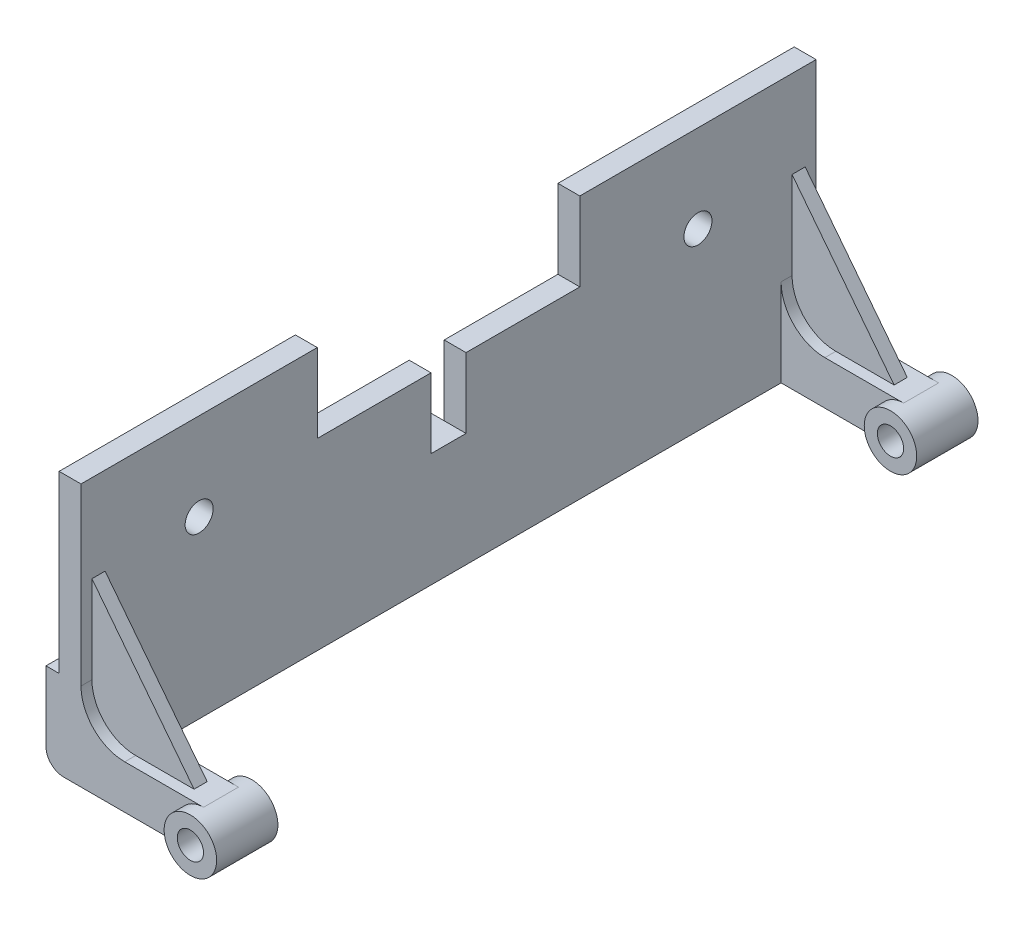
ISO-10303-21;
HEADER;
FILE_DESCRIPTION(('STEP AP214'),'2;1');
FILE_NAME('part.step','',(''),(''),'','','');
FILE_SCHEMA(('AUTOMOTIVE_DESIGN { 1 0 10303 214 1 1 1 1 }'));
ENDSEC;
DATA;
#1=APPLICATION_CONTEXT('core data for automotive mechanical design processes');
#2=APPLICATION_PROTOCOL_DEFINITION('international standard','automotive_design',2000,#1);
#3=PRODUCT_CONTEXT('',#1,'mechanical');
#4=PRODUCT('Part','Part','',(#3));
#5=PRODUCT_RELATED_PRODUCT_CATEGORY('part','',(#4));
#6=PRODUCT_DEFINITION_FORMATION('','',#4);
#7=PRODUCT_DEFINITION_CONTEXT('part definition',#1,'design');
#8=PRODUCT_DEFINITION('design','',#6,#7);
#9=PRODUCT_DEFINITION_SHAPE('','',#8);
#10=(LENGTH_UNIT() NAMED_UNIT(*) SI_UNIT(.MILLI.,.METRE.));
#11=(NAMED_UNIT(*) PLANE_ANGLE_UNIT() SI_UNIT($,.RADIAN.));
#12=(NAMED_UNIT(*) SI_UNIT($,.STERADIAN.) SOLID_ANGLE_UNIT());
#13=UNCERTAINTY_MEASURE_WITH_UNIT(LENGTH_MEASURE(1.E-05),#10,'distance_accuracy_value','');
#14=(GEOMETRIC_REPRESENTATION_CONTEXT(3) GLOBAL_UNCERTAINTY_ASSIGNED_CONTEXT((#13)) GLOBAL_UNIT_ASSIGNED_CONTEXT((#10,
#11,#12)) REPRESENTATION_CONTEXT('',''));
#15=CARTESIAN_POINT('',(0.,0.,0.));
#16=DIRECTION('',(0.,0.,1.));
#17=DIRECTION('',(1.,0.,0.));
#18=AXIS2_PLACEMENT_3D('',#15,#16,#17);
#19=CARTESIAN_POINT('',(-18.,8.,42.));
#20=DIRECTION('',(0.,1.,0.));
#21=DIRECTION('',(0.,0.,1.));
#22=AXIS2_PLACEMENT_3D('',#19,#20,#21);
#23=PLANE('',#22);
#24=DIRECTION('',(0.,0.,-1.));
#25=VECTOR('',#24,1.);
#26=CARTESIAN_POINT('',(-16.5,8.,42.));
#27=LINE('',#26,#25);
#28=CARTESIAN_POINT('',(-16.5,8.,42.));
#29=VERTEX_POINT('',#28);
#30=CARTESIAN_POINT('',(-16.5,8.,2.00000000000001));
#31=VERTEX_POINT('',#30);
#32=EDGE_CURVE('E281',#29,#31,#27,.T.);
#33=ORIENTED_EDGE('',*,*,#32,.T.);
#34=DIRECTION('',(1.,0.,0.));
#35=VECTOR('',#34,1.);
#36=CARTESIAN_POINT('',(-23.,7.99999999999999,2.00000000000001));
#37=LINE('',#36,#35);
#38=CARTESIAN_POINT('',(-18.,7.99999999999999,2.00000000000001));
#39=VERTEX_POINT('',#38);
#40=EDGE_CURVE('E275',#39,#31,#37,.T.);
#41=ORIENTED_EDGE('',*,*,#40,.F.);
#42=DIRECTION('',(0.,0.,-1.));
#43=VECTOR('',#42,1.);
#44=CARTESIAN_POINT('',(-18.,8.,42.));
#45=LINE('',#44,#43);
#46=CARTESIAN_POINT('',(-18.,8.,42.));
#47=VERTEX_POINT('',#46);
#48=EDGE_CURVE('E290',#47,#39,#45,.T.);
#49=ORIENTED_EDGE('',*,*,#48,.F.);
#50=DIRECTION('',(1.,0.,0.));
#51=VECTOR('',#50,1.);
#52=CARTESIAN_POINT('',(-18.,8.,42.));
#53=LINE('',#52,#51);
#54=EDGE_CURVE('E558',#47,#29,#53,.T.);
#55=ORIENTED_EDGE('',*,*,#54,.T.);
#56=EDGE_LOOP('',(#33,#41,#49,#55));
#57=FACE_BOUND('',#56,.T.);
#58=ADVANCED_FACE('F32',(#57),#23,.T.);
#59=CARTESIAN_POINT('',(-18.,8.,-2.));
#60=VERTEX_POINT('',#59);
#61=CARTESIAN_POINT('',(-18.,8.,-42.));
#62=VERTEX_POINT('',#61);
#63=EDGE_CURVE('E273',#60,#62,#45,.T.);
#64=ORIENTED_EDGE('',*,*,#63,.F.);
#65=DIRECTION('',(1.,0.,0.));
#66=VECTOR('',#65,1.);
#67=CARTESIAN_POINT('',(-23.,7.99999999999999,-2.));
#68=LINE('',#67,#66);
#69=CARTESIAN_POINT('',(-16.5,8.,-2.));
#70=VERTEX_POINT('',#69);
#71=EDGE_CURVE('E258',#60,#70,#68,.T.);
#72=ORIENTED_EDGE('',*,*,#71,.T.);
#73=CARTESIAN_POINT('',(-16.5,8.,-42.));
#74=VERTEX_POINT('',#73);
#75=EDGE_CURVE('E271',#70,#74,#27,.T.);
#76=ORIENTED_EDGE('',*,*,#75,.T.);
#77=DIRECTION('',(1.,0.,0.));
#78=VECTOR('',#77,1.);
#79=CARTESIAN_POINT('',(-18.,8.,-42.));
#80=LINE('',#79,#78);
#81=EDGE_CURVE('E488',#62,#74,#80,.T.);
#82=ORIENTED_EDGE('',*,*,#81,.F.);
#83=EDGE_LOOP('',(#64,#72,#76,#82));
#84=FACE_BOUND('',#83,.T.);
#85=ADVANCED_FACE('F269',(#84),#23,.T.);
#86=CARTESIAN_POINT('',(-16.5,28.,42.));
#87=DIRECTION('',(-1.,0.,0.));
#88=DIRECTION('',(0.,-1.,0.));
#89=AXIS2_PLACEMENT_3D('',#86,#87,#88);
#90=PLANE('',#89);
#91=CARTESIAN_POINT('',(-16.5,18.,28.5));
#92=DIRECTION('',(-1.,0.,0.));
#93=DIRECTION('',(0.,-1.,0.));
#94=AXIS2_PLACEMENT_3D('',#91,#92,#93);
#95=CIRCLE('',#94,1.6);
#96=CARTESIAN_POINT('',(-16.5,16.4,28.5));
#97=VERTEX_POINT('',#96);
#98=EDGE_CURVE('E438',#97,#97,#95,.T.);
#99=ORIENTED_EDGE('',*,*,#98,.F.);
#100=EDGE_LOOP('',(#99));
#101=FACE_BOUND('',#100,.T.);
#102=DIRECTION('',(0.,1.,0.));
#103=VECTOR('',#102,1.);
#104=CARTESIAN_POINT('',(-16.5,28.,2.));
#105=LINE('',#104,#103);
#106=CARTESIAN_POINT('',(-16.5,11.,2.));
#107=VERTEX_POINT('',#106);
#108=CARTESIAN_POINT('',(-16.5,19.,2.));
#109=VERTEX_POINT('',#108);
#110=EDGE_CURVE('E1126',#107,#109,#105,.T.);
#111=ORIENTED_EDGE('',*,*,#110,.F.);
#112=DIRECTION('',(0.,1.,0.));
#113=VECTOR('',#112,1.);
#114=CARTESIAN_POINT('',(-16.5,11.,2.00000000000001));
#115=LINE('',#114,#113);
#116=EDGE_CURVE('E266',#31,#107,#115,.T.);
#117=ORIENTED_EDGE('',*,*,#116,.F.);
#118=ORIENTED_EDGE('',*,*,#32,.F.);
#119=DIRECTION('',(0.,1.,0.));
#120=VECTOR('',#119,1.);
#121=CARTESIAN_POINT('',(-16.5,28.,42.));
#122=LINE('',#121,#120);
#123=CARTESIAN_POINT('',(-16.5,28.,42.));
#124=VERTEX_POINT('',#123);
#125=EDGE_CURVE('E1157',#29,#124,#122,.T.);
#126=ORIENTED_EDGE('',*,*,#125,.T.);
#127=DIRECTION('',(0.,0.,-1.));
#128=VECTOR('',#127,1.);
#129=CARTESIAN_POINT('',(-16.5,28.,42.));
#130=LINE('',#129,#128);
#131=CARTESIAN_POINT('',(-16.5,28.,15.));
#132=VERTEX_POINT('',#131);
#133=EDGE_CURVE('E282',#124,#132,#130,.T.);
#134=ORIENTED_EDGE('',*,*,#133,.T.);
#135=DIRECTION('',(0.,1.,0.));
#136=VECTOR('',#135,1.);
#137=CARTESIAN_POINT('',(-16.5,28.,15.));
#138=LINE('',#137,#136);
#139=CARTESIAN_POINT('',(-16.5,19.,15.));
#140=VERTEX_POINT('',#139);
#141=EDGE_CURVE('E1117',#140,#132,#138,.T.);
#142=ORIENTED_EDGE('',*,*,#141,.F.);
#143=DIRECTION('',(0.,0.,1.));
#144=VECTOR('',#143,1.);
#145=CARTESIAN_POINT('',(-16.5,19.,-15.));
#146=LINE('',#145,#144);
#147=EDGE_CURVE('E1124',#109,#140,#146,.T.);
#148=ORIENTED_EDGE('',*,*,#147,.F.);
#149=EDGE_LOOP('',(#111,#117,#118,#126,#134,#142,#148));
#150=FACE_BOUND('',#149,.T.);
#151=ADVANCED_FACE('F655',(#101,#150),#90,.T.);
#152=CARTESIAN_POINT('',(-16.5,18.,-28.5));
#153=DIRECTION('',(1.,0.,0.));
#154=DIRECTION('',(0.,-1.,0.));
#155=AXIS2_PLACEMENT_3D('',#152,#153,#154);
#156=CIRCLE('',#155,1.6);
#157=CARTESIAN_POINT('',(-16.5,16.4,-28.5));
#158=VERTEX_POINT('',#157);
#159=EDGE_CURVE('E472',#158,#158,#156,.T.);
#160=ORIENTED_EDGE('',*,*,#159,.T.);
#161=EDGE_LOOP('',(#160));
#162=FACE_BOUND('',#161,.T.);
#163=ORIENTED_EDGE('',*,*,#75,.F.);
#164=DIRECTION('',(0.,-1.,0.));
#165=VECTOR('',#164,1.);
#166=CARTESIAN_POINT('',(-16.5,11.,-2.));
#167=LINE('',#166,#165);
#168=CARTESIAN_POINT('',(-16.5,11.,-2.));
#169=VERTEX_POINT('',#168);
#170=EDGE_CURVE('E254',#169,#70,#167,.T.);
#171=ORIENTED_EDGE('',*,*,#170,.F.);
#172=DIRECTION('',(0.,-1.,0.));
#173=VECTOR('',#172,1.);
#174=CARTESIAN_POINT('',(-16.5,28.,-1.99999999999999));
#175=LINE('',#174,#173);
#176=CARTESIAN_POINT('',(-16.5,19.,-2.));
#177=VERTEX_POINT('',#176);
#178=EDGE_CURVE('E1128',#177,#169,#175,.T.);
#179=ORIENTED_EDGE('',*,*,#178,.F.);
#180=CARTESIAN_POINT('',(-16.5,19.,-15.));
#181=VERTEX_POINT('',#180);
#182=EDGE_CURVE('E460',#181,#177,#146,.T.);
#183=ORIENTED_EDGE('',*,*,#182,.F.);
#184=DIRECTION('',(0.,-1.,0.));
#185=VECTOR('',#184,1.);
#186=CARTESIAN_POINT('',(-16.5,28.,-15.));
#187=LINE('',#186,#185);
#188=CARTESIAN_POINT('',(-16.5,28.,-15.));
#189=VERTEX_POINT('',#188);
#190=EDGE_CURVE('E55',#189,#181,#187,.T.);
#191=ORIENTED_EDGE('',*,*,#190,.F.);
#192=CARTESIAN_POINT('',(-16.5,28.,-42.));
#193=VERTEX_POINT('',#192);
#194=EDGE_CURVE('E286',#189,#193,#130,.T.);
#195=ORIENTED_EDGE('',*,*,#194,.T.);
#196=DIRECTION('',(0.,1.,0.));
#197=VECTOR('',#196,1.);
#198=CARTESIAN_POINT('',(-16.5,28.,-42.));
#199=LINE('',#198,#197);
#200=EDGE_CURVE('E279',#74,#193,#199,.T.);
#201=ORIENTED_EDGE('',*,*,#200,.F.);
#202=EDGE_LOOP('',(#163,#171,#179,#183,#191,#195,#201));
#203=FACE_BOUND('',#202,.T.);
#204=ADVANCED_FACE('F277',(#162,#203),#90,.T.);
#205=CARTESIAN_POINT('',(3.,19.,-15.));
#206=DIRECTION('',(0.,-1.,0.));
#207=DIRECTION('',(1.,0.,0.));
#208=AXIS2_PLACEMENT_3D('',#205,#206,#207);
#209=PLANE('',#208);
#210=DIRECTION('',(0.,0.,1.));
#211=VECTOR('',#210,1.);
#212=CARTESIAN_POINT('',(-14.,19.,42.));
#213=LINE('',#212,#211);
#214=CARTESIAN_POINT('',(-14.,19.,2.));
#215=VERTEX_POINT('',#214);
#216=CARTESIAN_POINT('',(-14.,19.,15.));
#217=VERTEX_POINT('',#216);
#218=EDGE_CURVE('E463',#215,#217,#213,.T.);
#219=ORIENTED_EDGE('',*,*,#218,.F.);
#220=DIRECTION('',(-1.,0.,0.));
#221=VECTOR('',#220,1.);
#222=CARTESIAN_POINT('',(3.,19.,2.));
#223=LINE('',#222,#221);
#224=EDGE_CURVE('E11',#215,#109,#223,.T.);
#225=ORIENTED_EDGE('',*,*,#224,.T.);
#226=ORIENTED_EDGE('',*,*,#147,.T.);
#227=DIRECTION('',(-1.,0.,0.));
#228=VECTOR('',#227,1.);
#229=CARTESIAN_POINT('',(3.,19.,15.));
#230=LINE('',#229,#228);
#231=EDGE_CURVE('E1110',#217,#140,#230,.T.);
#232=ORIENTED_EDGE('',*,*,#231,.F.);
#233=EDGE_LOOP('',(#219,#225,#226,#232));
#234=FACE_BOUND('',#233,.T.);
#235=ADVANCED_FACE('F829',(#234),#209,.F.);
#236=CARTESIAN_POINT('',(-18.,28.,42.));
#237=DIRECTION('',(0.,-1.,0.));
#238=DIRECTION('',(0.,0.,-1.));
#239=AXIS2_PLACEMENT_3D('',#236,#237,#238);
#240=PLANE('',#239);
#241=ORIENTED_EDGE('',*,*,#194,.F.);
#242=DIRECTION('',(-1.,0.,0.));
#243=VECTOR('',#242,1.);
#244=CARTESIAN_POINT('',(3.,28.,-15.));
#245=LINE('',#244,#243);
#246=CARTESIAN_POINT('',(-14.,28.,-15.));
#247=VERTEX_POINT('',#246);
#248=EDGE_CURVE('E376',#247,#189,#245,.T.);
#249=ORIENTED_EDGE('',*,*,#248,.F.);
#250=DIRECTION('',(0.,0.,-1.));
#251=VECTOR('',#250,1.);
#252=CARTESIAN_POINT('',(-14.,28.,42.));
#253=LINE('',#252,#251);
#254=CARTESIAN_POINT('',(-14.,28.,-42.));
#255=VERTEX_POINT('',#254);
#256=EDGE_CURVE('E359',#247,#255,#253,.T.);
#257=ORIENTED_EDGE('',*,*,#256,.T.);
#258=DIRECTION('',(-1.,0.,0.));
#259=VECTOR('',#258,1.);
#260=CARTESIAN_POINT('',(-18.,28.,-42.));
#261=LINE('',#260,#259);
#262=EDGE_CURVE('E375',#255,#193,#261,.T.);
#263=ORIENTED_EDGE('',*,*,#262,.T.);
#264=EDGE_LOOP('',(#241,#249,#257,#263));
#265=FACE_BOUND('',#264,.T.);
#266=ADVANCED_FACE('F373',(#265),#240,.F.);
#267=CARTESIAN_POINT('',(-18.,28.,42.));
#268=DIRECTION('',(0.,0.,-1.));
#269=DIRECTION('',(-1.,0.,0.));
#270=AXIS2_PLACEMENT_3D('',#267,#268,#269);
#271=PLANE('',#270);
#272=DIRECTION('',(0.,-1.,0.));
#273=VECTOR('',#272,1.);
#274=CARTESIAN_POINT('',(-18.,-2.,42.));
#275=LINE('',#274,#273);
#276=CARTESIAN_POINT('',(-18.,0.,42.));
#277=VERTEX_POINT('',#276);
#278=EDGE_CURVE('E325',#47,#277,#275,.T.);
#279=ORIENTED_EDGE('',*,*,#278,.T.);
#280=CARTESIAN_POINT('',(-16.,0.,42.));
#281=DIRECTION('',(0.,0.,-1.));
#282=DIRECTION('',(-1.,0.,0.));
#283=AXIS2_PLACEMENT_3D('',#280,#281,#282);
#284=CIRCLE('',#283,2.);
#285=CARTESIAN_POINT('',(-16.,-2.,42.));
#286=VERTEX_POINT('',#285);
#287=EDGE_CURVE('E453',#277,#286,#284,.F.);
#288=ORIENTED_EDGE('',*,*,#287,.T.);
#289=DIRECTION('',(1.,0.,0.));
#290=VECTOR('',#289,1.);
#291=CARTESIAN_POINT('',(-18.,-2.,42.));
#292=LINE('',#291,#290);
#293=CARTESIAN_POINT('',(-2.23606797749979,-2.,42.));
#294=VERTEX_POINT('',#293);
#295=EDGE_CURVE('E352',#286,#294,#292,.T.);
#296=ORIENTED_EDGE('',*,*,#295,.T.);
#297=CARTESIAN_POINT('',(0.,0.,42.));
#298=DIRECTION('',(0.,0.,1.));
#299=DIRECTION('',(1.,0.,0.));
#300=AXIS2_PLACEMENT_3D('',#297,#298,#299);
#301=CIRCLE('',#300,3.);
#302=CARTESIAN_POINT('',(0.,3.,42.));
#303=VERTEX_POINT('',#302);
#304=EDGE_CURVE('E554',#303,#294,#301,.T.);
#305=ORIENTED_EDGE('',*,*,#304,.F.);
#306=DIRECTION('',(-1.,0.,0.));
#307=VECTOR('',#306,1.);
#308=CARTESIAN_POINT('',(0.,3.,42.));
#309=LINE('',#308,#307);
#310=CARTESIAN_POINT('',(-9.,3.,42.));
#311=VERTEX_POINT('',#310);
#312=EDGE_CURVE('E317',#303,#311,#309,.T.);
#313=ORIENTED_EDGE('',*,*,#312,.T.);
#314=CARTESIAN_POINT('',(-9.,8.,42.));
#315=DIRECTION('',(0.,0.,-1.));
#316=DIRECTION('',(-1.,0.,0.));
#317=AXIS2_PLACEMENT_3D('',#314,#315,#316);
#318=CIRCLE('',#317,5.);
#319=CARTESIAN_POINT('',(-14.,8.,42.));
#320=VERTEX_POINT('',#319);
#321=EDGE_CURVE('E613',#311,#320,#318,.T.);
#322=ORIENTED_EDGE('',*,*,#321,.T.);
#323=DIRECTION('',(0.,1.,0.));
#324=VECTOR('',#323,1.);
#325=CARTESIAN_POINT('',(-14.,-2.,42.));
#326=LINE('',#325,#324);
#327=CARTESIAN_POINT('',(-14.,28.,42.));
#328=VERTEX_POINT('',#327);
#329=EDGE_CURVE('E349',#320,#328,#326,.T.);
#330=ORIENTED_EDGE('',*,*,#329,.T.);
#331=DIRECTION('',(-1.,0.,0.));
#332=VECTOR('',#331,1.);
#333=CARTESIAN_POINT('',(-18.,28.,42.));
#334=LINE('',#333,#332);
#335=EDGE_CURVE('E351',#328,#124,#334,.T.);
#336=ORIENTED_EDGE('',*,*,#335,.T.);
#337=ORIENTED_EDGE('',*,*,#125,.F.);
#338=ORIENTED_EDGE('',*,*,#54,.F.);
#339=EDGE_LOOP('',(#279,#288,#296,#305,#313,#322,#330,#336,#337,#338));
#340=FACE_BOUND('',#339,.T.);
#341=ADVANCED_FACE('F586',(#340),#271,.F.);
#342=CARTESIAN_POINT('',(-18.,-2.,42.));
#343=DIRECTION('',(1.,0.,0.));
#344=DIRECTION('',(0.,0.,-1.));
#345=AXIS2_PLACEMENT_3D('',#342,#343,#344);
#346=PLANE('',#345);
#347=DIRECTION('',(0.,-1.,0.));
#348=VECTOR('',#347,1.);
#349=CARTESIAN_POINT('',(-18.,-2.,-42.));
#350=LINE('',#349,#348);
#351=CARTESIAN_POINT('',(-18.,0.,-42.));
#352=VERTEX_POINT('',#351);
#353=EDGE_CURVE('E414',#62,#352,#350,.T.);
#354=ORIENTED_EDGE('',*,*,#353,.T.);
#355=DIRECTION('',(0.,0.,-1.));
#356=VECTOR('',#355,1.);
#357=CARTESIAN_POINT('',(-18.,0.,42.));
#358=LINE('',#357,#356);
#359=EDGE_CURVE('E451',#352,#277,#358,.F.);
#360=ORIENTED_EDGE('',*,*,#359,.T.);
#361=ORIENTED_EDGE('',*,*,#278,.F.);
#362=ORIENTED_EDGE('',*,*,#48,.T.);
#363=DIRECTION('',(0.,-1.,0.));
#364=VECTOR('',#363,1.);
#365=CARTESIAN_POINT('',(-18.,11.,2.00000000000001));
#366=LINE('',#365,#364);
#367=CARTESIAN_POINT('',(-18.,11.,2.00000000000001));
#368=VERTEX_POINT('',#367);
#369=EDGE_CURVE('E1141',#368,#39,#366,.T.);
#370=ORIENTED_EDGE('',*,*,#369,.F.);
#371=DIRECTION('',(0.,0.,1.));
#372=VECTOR('',#371,1.);
#373=CARTESIAN_POINT('',(-18.,11.,-2.));
#374=LINE('',#373,#372);
#375=CARTESIAN_POINT('',(-18.,11.,-2.));
#376=VERTEX_POINT('',#375);
#377=EDGE_CURVE('E274',#376,#368,#374,.T.);
#378=ORIENTED_EDGE('',*,*,#377,.F.);
#379=DIRECTION('',(0.,1.,0.));
#380=VECTOR('',#379,1.);
#381=CARTESIAN_POINT('',(-18.,11.,-2.));
#382=LINE('',#381,#380);
#383=EDGE_CURVE('E1139',#60,#376,#382,.T.);
#384=ORIENTED_EDGE('',*,*,#383,.F.);
#385=ORIENTED_EDGE('',*,*,#63,.T.);
#386=EDGE_LOOP('',(#354,#360,#361,#362,#370,#378,#384,#385));
#387=FACE_BOUND('',#386,.T.);
#388=ADVANCED_FACE('F34',(#387),#346,.F.);
#389=CARTESIAN_POINT('',(-14.,28.,15.));
#390=VERTEX_POINT('',#389);
#391=EDGE_CURVE('E360',#328,#390,#253,.T.);
#392=ORIENTED_EDGE('',*,*,#391,.T.);
#393=DIRECTION('',(-1.,0.,0.));
#394=VECTOR('',#393,1.);
#395=CARTESIAN_POINT('',(3.,28.,15.));
#396=LINE('',#395,#394);
#397=EDGE_CURVE('E1116',#390,#132,#396,.T.);
#398=ORIENTED_EDGE('',*,*,#397,.T.);
#399=ORIENTED_EDGE('',*,*,#133,.F.);
#400=ORIENTED_EDGE('',*,*,#335,.F.);
#401=EDGE_LOOP('',(#392,#398,#399,#400));
#402=FACE_BOUND('',#401,.T.);
#403=ADVANCED_FACE('F648',(#402),#240,.F.);
#404=CARTESIAN_POINT('',(-9.,8.,38.));
#405=DIRECTION('',(0.,0.,1.));
#406=DIRECTION('',(1.,0.,0.));
#407=AXIS2_PLACEMENT_3D('',#404,#405,#406);
#408=CYLINDRICAL_SURFACE('',#407,5.);
#409=CARTESIAN_POINT('',(-9.,8.,39.25));
#410=DIRECTION('',(0.,0.,1.));
#411=DIRECTION('',(1.,0.,0.));
#412=AXIS2_PLACEMENT_3D('',#409,#410,#411);
#413=CIRCLE('',#412,5.);
#414=CARTESIAN_POINT('',(-9.,3.,39.25));
#415=VERTEX_POINT('',#414);
#416=CARTESIAN_POINT('',(-14.,8.,39.25));
#417=VERTEX_POINT('',#416);
#418=EDGE_CURVE('E612',#415,#417,#413,.F.);
#419=ORIENTED_EDGE('',*,*,#418,.F.);
#420=DIRECTION('',(0.,0.,1.));
#421=VECTOR('',#420,1.);
#422=CARTESIAN_POINT('',(-9.,3.,38.));
#423=LINE('',#422,#421);
#424=CARTESIAN_POINT('',(-9.,3.,38.));
#425=VERTEX_POINT('',#424);
#426=EDGE_CURVE('E345',#425,#415,#423,.T.);
#427=ORIENTED_EDGE('',*,*,#426,.F.);
#428=CARTESIAN_POINT('',(-9.,8.,38.));
#429=DIRECTION('',(0.,0.,1.));
#430=DIRECTION('',(1.,0.,0.));
#431=AXIS2_PLACEMENT_3D('',#428,#429,#430);
#432=CIRCLE('',#431,5.);
#433=CARTESIAN_POINT('',(-14.,8.,38.));
#434=VERTEX_POINT('',#433);
#435=EDGE_CURVE('E608',#434,#425,#432,.T.);
#436=ORIENTED_EDGE('',*,*,#435,.F.);
#437=DIRECTION('',(0.,0.,1.));
#438=VECTOR('',#437,1.);
#439=CARTESIAN_POINT('',(-14.,8.,42.));
#440=LINE('',#439,#438);
#441=EDGE_CURVE('E348',#417,#434,#440,.F.);
#442=ORIENTED_EDGE('',*,*,#441,.F.);
#443=EDGE_LOOP('',(#419,#427,#436,#442));
#444=FACE_BOUND('',#443,.T.);
#445=ADVANCED_FACE('F611',(#444),#408,.F.);
#446=CARTESIAN_POINT('',(0.,0.,38.));
#447=DIRECTION('',(0.,0.,1.));
#448=DIRECTION('',(1.,0.,0.));
#449=AXIS2_PLACEMENT_3D('',#446,#447,#448);
#450=PLANE('',#449);
#451=CARTESIAN_POINT('',(0.,0.,38.));
#452=DIRECTION('',(0.,0.,1.));
#453=DIRECTION('',(1.,0.,0.));
#454=AXIS2_PLACEMENT_3D('',#451,#452,#453);
#455=CIRCLE('',#454,3.);
#456=CARTESIAN_POINT('',(-2.23606797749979,-2.,38.));
#457=VERTEX_POINT('',#456);
#458=CARTESIAN_POINT('',(0.,3.,38.));
#459=VERTEX_POINT('',#458);
#460=EDGE_CURVE('E342',#457,#459,#455,.F.);
#461=ORIENTED_EDGE('',*,*,#460,.F.);
#462=DIRECTION('',(1.,0.,0.));
#463=VECTOR('',#462,1.);
#464=CARTESIAN_POINT('',(-14.,-2.,38.));
#465=LINE('',#464,#463);
#466=CARTESIAN_POINT('',(-14.,-2.,38.));
#467=VERTEX_POINT('',#466);
#468=EDGE_CURVE('E322',#467,#457,#465,.T.);
#469=ORIENTED_EDGE('',*,*,#468,.F.);
#470=DIRECTION('',(0.,-1.,0.));
#471=VECTOR('',#470,1.);
#472=CARTESIAN_POINT('',(-14.,3.,38.));
#473=LINE('',#472,#471);
#474=EDGE_CURVE('E321',#434,#467,#473,.T.);
#475=ORIENTED_EDGE('',*,*,#474,.F.);
#476=ORIENTED_EDGE('',*,*,#435,.T.);
#477=DIRECTION('',(-1.,0.,0.));
#478=VECTOR('',#477,1.);
#479=CARTESIAN_POINT('',(0.,3.,38.));
#480=LINE('',#479,#478);
#481=EDGE_CURVE('E318',#459,#425,#480,.T.);
#482=ORIENTED_EDGE('',*,*,#481,.F.);
#483=EDGE_LOOP('',(#461,#469,#475,#476,#482));
#484=FACE_BOUND('',#483,.T.);
#485=ADVANCED_FACE('F606',(#484),#450,.F.);
#486=CARTESIAN_POINT('',(-14.,-2.,42.));
#487=DIRECTION('',(-1.,0.,0.));
#488=DIRECTION('',(0.,0.,1.));
#489=AXIS2_PLACEMENT_3D('',#486,#487,#488);
#490=PLANE('',#489);
#491=DIRECTION('',(0.,0.,-1.));
#492=VECTOR('',#491,1.);
#493=CARTESIAN_POINT('',(-14.,11.,2.));
#494=LINE('',#493,#492);
#495=CARTESIAN_POINT('',(-14.,11.,2.));
#496=VERTEX_POINT('',#495);
#497=CARTESIAN_POINT('',(-14.,11.,-2.));
#498=VERTEX_POINT('',#497);
#499=EDGE_CURVE('E1135',#496,#498,#494,.T.);
#500=ORIENTED_EDGE('',*,*,#499,.F.);
#501=DIRECTION('',(0.,-1.,0.));
#502=VECTOR('',#501,1.);
#503=CARTESIAN_POINT('',(-14.,19.,2.));
#504=LINE('',#503,#502);
#505=EDGE_CURVE('E1114',#215,#496,#504,.T.);
#506=ORIENTED_EDGE('',*,*,#505,.F.);
#507=ORIENTED_EDGE('',*,*,#218,.T.);
#508=DIRECTION('',(0.,1.,0.));
#509=VECTOR('',#508,1.);
#510=CARTESIAN_POINT('',(-14.,-2.00000000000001,15.));
#511=LINE('',#510,#509);
#512=EDGE_CURVE('E462',#217,#390,#511,.T.);
#513=ORIENTED_EDGE('',*,*,#512,.T.);
#514=ORIENTED_EDGE('',*,*,#391,.F.);
#515=ORIENTED_EDGE('',*,*,#329,.F.);
#516=CARTESIAN_POINT('',(-14.,8.,40.75));
#517=VERTEX_POINT('',#516);
#518=EDGE_CURVE('E353',#320,#517,#440,.F.);
#519=ORIENTED_EDGE('',*,*,#518,.T.);
#520=DIRECTION('',(0.,1.,0.));
#521=VECTOR('',#520,1.);
#522=CARTESIAN_POINT('',(-14.,-2.,40.75));
#523=LINE('',#522,#521);
#524=CARTESIAN_POINT('',(-14.,18.,40.75));
#525=VERTEX_POINT('',#524);
#526=EDGE_CURVE('E307',#517,#525,#523,.T.);
#527=ORIENTED_EDGE('',*,*,#526,.T.);
#528=DIRECTION('',(0.,0.,1.));
#529=VECTOR('',#528,1.);
#530=CARTESIAN_POINT('',(-14.,18.,42.));
#531=LINE('',#530,#529);
#532=CARTESIAN_POINT('',(-14.,18.,39.25));
#533=VERTEX_POINT('',#532);
#534=EDGE_CURVE('E312',#525,#533,#531,.F.);
#535=ORIENTED_EDGE('',*,*,#534,.T.);
#536=DIRECTION('',(0.,1.,0.));
#537=VECTOR('',#536,1.);
#538=CARTESIAN_POINT('',(-14.,-2.,39.25));
#539=LINE('',#538,#537);
#540=EDGE_CURVE('E301',#417,#533,#539,.T.);
#541=ORIENTED_EDGE('',*,*,#540,.F.);
#542=ORIENTED_EDGE('',*,*,#441,.T.);
#543=ORIENTED_EDGE('',*,*,#474,.T.);
#544=DIRECTION('',(0.,0.,-1.));
#545=VECTOR('',#544,1.);
#546=CARTESIAN_POINT('',(-14.,-2.,42.));
#547=LINE('',#546,#545);
#548=CARTESIAN_POINT('',(-14.,-2.,-38.));
#549=VERTEX_POINT('',#548);
#550=EDGE_CURVE('E332',#467,#549,#547,.T.);
#551=ORIENTED_EDGE('',*,*,#550,.T.);
#552=DIRECTION('',(0.,-1.,0.));
#553=VECTOR('',#552,1.);
#554=CARTESIAN_POINT('',(-14.,3.,-38.));
#555=LINE('',#554,#553);
#556=CARTESIAN_POINT('',(-14.,8.,-38.));
#557=VERTEX_POINT('',#556);
#558=EDGE_CURVE('E403',#557,#549,#555,.T.);
#559=ORIENTED_EDGE('',*,*,#558,.F.);
#560=DIRECTION('',(0.,0.,-1.));
#561=VECTOR('',#560,1.);
#562=CARTESIAN_POINT('',(-14.,8.,-42.));
#563=LINE('',#562,#561);
#564=CARTESIAN_POINT('',(-14.,8.,-39.25));
#565=VERTEX_POINT('',#564);
#566=EDGE_CURVE('E528',#565,#557,#563,.F.);
#567=ORIENTED_EDGE('',*,*,#566,.F.);
#568=DIRECTION('',(0.,1.,0.));
#569=VECTOR('',#568,1.);
#570=CARTESIAN_POINT('',(-14.,-2.,-39.25));
#571=LINE('',#570,#569);
#572=CARTESIAN_POINT('',(-14.,18.,-39.25));
#573=VERTEX_POINT('',#572);
#574=EDGE_CURVE('E500',#565,#573,#571,.T.);
#575=ORIENTED_EDGE('',*,*,#574,.T.);
#576=DIRECTION('',(0.,0.,-1.));
#577=VECTOR('',#576,1.);
#578=CARTESIAN_POINT('',(-14.,18.,-42.));
#579=LINE('',#578,#577);
#580=CARTESIAN_POINT('',(-14.,18.,-40.75));
#581=VERTEX_POINT('',#580);
#582=EDGE_CURVE('E512',#581,#573,#579,.F.);
#583=ORIENTED_EDGE('',*,*,#582,.F.);
#584=DIRECTION('',(0.,1.,0.));
#585=VECTOR('',#584,1.);
#586=CARTESIAN_POINT('',(-14.,-2.,-40.75));
#587=LINE('',#586,#585);
#588=CARTESIAN_POINT('',(-14.,8.,-40.75));
#589=VERTEX_POINT('',#588);
#590=EDGE_CURVE('E506',#589,#581,#587,.T.);
#591=ORIENTED_EDGE('',*,*,#590,.F.);
#592=CARTESIAN_POINT('',(-14.,8.,-42.));
#593=VERTEX_POINT('',#592);
#594=EDGE_CURVE('E386',#593,#589,#563,.F.);
#595=ORIENTED_EDGE('',*,*,#594,.F.);
#596=DIRECTION('',(0.,1.,0.));
#597=VECTOR('',#596,1.);
#598=CARTESIAN_POINT('',(-14.,-2.,-42.));
#599=LINE('',#598,#597);
#600=EDGE_CURVE('E380',#593,#255,#599,.T.);
#601=ORIENTED_EDGE('',*,*,#600,.T.);
#602=ORIENTED_EDGE('',*,*,#256,.F.);
#603=DIRECTION('',(0.,-1.,0.));
#604=VECTOR('',#603,1.);
#605=CARTESIAN_POINT('',(-14.,-2.00000000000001,-15.));
#606=LINE('',#605,#604);
#607=CARTESIAN_POINT('',(-14.,19.,-15.));
#608=VERTEX_POINT('',#607);
#609=EDGE_CURVE('E461',#247,#608,#606,.T.);
#610=ORIENTED_EDGE('',*,*,#609,.T.);
#611=CARTESIAN_POINT('',(-14.,19.,-1.99999999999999));
#612=VERTEX_POINT('',#611);
#613=EDGE_CURVE('E458',#608,#612,#213,.T.);
#614=ORIENTED_EDGE('',*,*,#613,.T.);
#615=DIRECTION('',(0.,1.,0.));
#616=VECTOR('',#615,1.);
#617=CARTESIAN_POINT('',(-14.,19.,-2.));
#618=LINE('',#617,#616);
#619=EDGE_CURVE('E47',#498,#612,#618,.T.);
#620=ORIENTED_EDGE('',*,*,#619,.F.);
#621=EDGE_LOOP('',(#500,#506,#507,#513,#514,#515,#519,#527,#535,#541,#542,#543,#551,#559,#567,
#575,#583,#591,#595,#601,#602,#610,#614,#620));
#622=FACE_BOUND('',#621,.T.);
#623=CARTESIAN_POINT('',(-14.,18.,28.5));
#624=DIRECTION('',(-1.,0.,0.));
#625=DIRECTION('',(0.,0.,1.));
#626=AXIS2_PLACEMENT_3D('',#623,#624,#625);
#627=CIRCLE('',#626,1.6);
#628=CARTESIAN_POINT('',(-14.,18.,30.1));
#629=VERTEX_POINT('',#628);
#630=EDGE_CURVE('E542',#629,#629,#627,.T.);
#631=ORIENTED_EDGE('',*,*,#630,.T.);
#632=EDGE_LOOP('',(#631));
#633=FACE_BOUND('',#632,.T.);
#634=CARTESIAN_POINT('',(-14.,18.,-28.5));
#635=DIRECTION('',(1.,0.,0.));
#636=DIRECTION('',(0.,0.,-1.));
#637=AXIS2_PLACEMENT_3D('',#634,#635,#636);
#638=CIRCLE('',#637,1.6);
#639=CARTESIAN_POINT('',(-14.,18.,-30.1));
#640=VERTEX_POINT('',#639);
#641=EDGE_CURVE('E475',#640,#640,#638,.T.);
#642=ORIENTED_EDGE('',*,*,#641,.F.);
#643=EDGE_LOOP('',(#642));
#644=FACE_BOUND('',#643,.T.);
#645=ADVANCED_FACE('F382',(#622,#633,#644),#490,.F.);
#646=CARTESIAN_POINT('',(-18.,-2.,42.));
#647=DIRECTION('',(0.,1.,0.));
#648=DIRECTION('',(0.,0.,1.));
#649=AXIS2_PLACEMENT_3D('',#646,#647,#648);
#650=PLANE('',#649);
#651=ORIENTED_EDGE('',*,*,#295,.F.);
#652=DIRECTION('',(0.,0.,-1.));
#653=VECTOR('',#652,1.);
#654=CARTESIAN_POINT('',(-16.,-2.,42.));
#655=LINE('',#654,#653);
#656=CARTESIAN_POINT('',(-16.,-2.,-42.));
#657=VERTEX_POINT('',#656);
#658=EDGE_CURVE('E445',#286,#657,#655,.T.);
#659=ORIENTED_EDGE('',*,*,#658,.T.);
#660=DIRECTION('',(1.,0.,0.));
#661=VECTOR('',#660,1.);
#662=CARTESIAN_POINT('',(-18.,-2.,-42.));
#663=LINE('',#662,#661);
#664=CARTESIAN_POINT('',(-2.23606797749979,-2.,-42.));
#665=VERTEX_POINT('',#664);
#666=EDGE_CURVE('E390',#657,#665,#663,.T.);
#667=ORIENTED_EDGE('',*,*,#666,.T.);
#668=DIRECTION('',(0.,0.,-1.));
#669=VECTOR('',#668,1.);
#670=CARTESIAN_POINT('',(-2.23606797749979,-2.,-38.));
#671=LINE('',#670,#669);
#672=CARTESIAN_POINT('',(-2.23606797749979,-2.,-38.));
#673=VERTEX_POINT('',#672);
#674=EDGE_CURVE('E407',#673,#665,#671,.T.);
#675=ORIENTED_EDGE('',*,*,#674,.F.);
#676=DIRECTION('',(1.,0.,0.));
#677=VECTOR('',#676,1.);
#678=CARTESIAN_POINT('',(-14.,-2.,-38.));
#679=LINE('',#678,#677);
#680=EDGE_CURVE('E409',#549,#673,#679,.T.);
#681=ORIENTED_EDGE('',*,*,#680,.F.);
#682=ORIENTED_EDGE('',*,*,#550,.F.);
#683=ORIENTED_EDGE('',*,*,#468,.T.);
#684=DIRECTION('',(0.,0.,1.));
#685=VECTOR('',#684,1.);
#686=CARTESIAN_POINT('',(-2.23606797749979,-2.,38.));
#687=LINE('',#686,#685);
#688=EDGE_CURVE('E331',#457,#294,#687,.T.);
#689=ORIENTED_EDGE('',*,*,#688,.T.);
#690=EDGE_LOOP('',(#651,#659,#667,#675,#681,#682,#683,#689));
#691=FACE_BOUND('',#690,.T.);
#692=ADVANCED_FACE('F576',(#691),#650,.F.);
#693=CARTESIAN_POINT('',(0.,3.,38.));
#694=DIRECTION('',(0.,1.,0.));
#695=DIRECTION('',(-1.,0.,0.));
#696=AXIS2_PLACEMENT_3D('',#693,#694,#695);
#697=PLANE('',#696);
#698=DIRECTION('',(1.,0.,0.));
#699=VECTOR('',#698,1.);
#700=CARTESIAN_POINT('',(0.,3.,40.75));
#701=LINE('',#700,#699);
#702=CARTESIAN_POINT('',(-9.,3.,40.75));
#703=VERTEX_POINT('',#702);
#704=CARTESIAN_POINT('',(-2.33333333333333,3.,40.75));
#705=VERTEX_POINT('',#704);
#706=EDGE_CURVE('E304',#703,#705,#701,.T.);
#707=ORIENTED_EDGE('',*,*,#706,.F.);
#708=EDGE_CURVE('E344',#703,#311,#423,.T.);
#709=ORIENTED_EDGE('',*,*,#708,.T.);
#710=ORIENTED_EDGE('',*,*,#312,.F.);
#711=DIRECTION('',(0.,0.,1.));
#712=VECTOR('',#711,1.);
#713=CARTESIAN_POINT('',(0.,3.,38.));
#714=LINE('',#713,#712);
#715=EDGE_CURVE('E566',#459,#303,#714,.T.);
#716=ORIENTED_EDGE('',*,*,#715,.F.);
#717=ORIENTED_EDGE('',*,*,#481,.T.);
#718=ORIENTED_EDGE('',*,*,#426,.T.);
#719=DIRECTION('',(1.,0.,0.));
#720=VECTOR('',#719,1.);
#721=CARTESIAN_POINT('',(0.,3.,39.25));
#722=LINE('',#721,#720);
#723=CARTESIAN_POINT('',(-2.33333333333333,3.,39.25));
#724=VERTEX_POINT('',#723);
#725=EDGE_CURVE('E299',#415,#724,#722,.T.);
#726=ORIENTED_EDGE('',*,*,#725,.T.);
#727=DIRECTION('',(0.,0.,1.));
#728=VECTOR('',#727,1.);
#729=CARTESIAN_POINT('',(-2.33333333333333,3.,38.));
#730=LINE('',#729,#728);
#731=EDGE_CURVE('E309',#705,#724,#730,.F.);
#732=ORIENTED_EDGE('',*,*,#731,.F.);
#733=EDGE_LOOP('',(#707,#709,#710,#716,#717,#718,#726,#732));
#734=FACE_BOUND('',#733,.T.);
#735=ADVANCED_FACE('F634',(#734),#697,.T.);
#736=CARTESIAN_POINT('',(0.,0.,38.));
#737=DIRECTION('',(0.,0.,1.));
#738=DIRECTION('',(1.,0.,0.));
#739=AXIS2_PLACEMENT_3D('',#736,#737,#738);
#740=CYLINDRICAL_SURFACE('',#739,3.);
#741=ORIENTED_EDGE('',*,*,#715,.T.);
#742=ORIENTED_EDGE('',*,*,#304,.T.);
#743=ORIENTED_EDGE('',*,*,#688,.F.);
#744=ORIENTED_EDGE('',*,*,#460,.T.);
#745=EDGE_LOOP('',(#741,#742,#743,#744));
#746=FACE_BOUND('',#745,.T.);
#747=CARTESIAN_POINT('',(0.,0.,36.5));
#748=DIRECTION('',(0.,0.,-1.));
#749=DIRECTION('',(-1.,0.,0.));
#750=AXIS2_PLACEMENT_3D('',#747,#748,#749);
#751=CIRCLE('',#750,3.);
#752=CARTESIAN_POINT('',(-3.,0.,36.5));
#753=VERTEX_POINT('',#752);
#754=EDGE_CURVE('E314',#753,#753,#751,.T.);
#755=ORIENTED_EDGE('',*,*,#754,.F.);
#756=EDGE_LOOP('',(#755));
#757=FACE_BOUND('',#756,.T.);
#758=CARTESIAN_POINT('',(0.,0.,43.5));
#759=DIRECTION('',(0.,0.,1.));
#760=DIRECTION('',(1.,0.,0.));
#761=AXIS2_PLACEMENT_3D('',#758,#759,#760);
#762=CIRCLE('',#761,3.);
#763=CARTESIAN_POINT('',(3.,0.,43.5));
#764=VERTEX_POINT('',#763);
#765=EDGE_CURVE('E555',#764,#764,#762,.T.);
#766=ORIENTED_EDGE('',*,*,#765,.F.);
#767=EDGE_LOOP('',(#766));
#768=FACE_BOUND('',#767,.T.);
#769=ADVANCED_FACE('F581',(#746,#757,#768),#740,.T.);
#770=CARTESIAN_POINT('',(0.,0.,36.5));
#771=DIRECTION('',(0.,0.,-1.));
#772=DIRECTION('',(-1.,0.,0.));
#773=AXIS2_PLACEMENT_3D('',#770,#771,#772);
#774=PLANE('',#773);
#775=CARTESIAN_POINT('',(0.,0.,36.5));
#776=DIRECTION('',(0.,0.,-1.));
#777=DIRECTION('',(-1.,0.,0.));
#778=AXIS2_PLACEMENT_3D('',#775,#776,#777);
#779=CIRCLE('',#778,1.5);
#780=CARTESIAN_POINT('',(1.5,0.,36.5));
#781=VERTEX_POINT('',#780);
#782=EDGE_CURVE('E549',#781,#781,#779,.T.);
#783=ORIENTED_EDGE('',*,*,#782,.F.);
#784=EDGE_LOOP('',(#783));
#785=FACE_BOUND('',#784,.T.);
#786=ORIENTED_EDGE('',*,*,#754,.T.);
#787=EDGE_LOOP('',(#786));
#788=FACE_BOUND('',#787,.T.);
#789=ADVANCED_FACE('F638',(#785,#788),#774,.T.);
#790=ORIENTED_EDGE('',*,*,#708,.F.);
#791=CARTESIAN_POINT('',(-9.,8.,40.75));
#792=DIRECTION('',(0.,0.,1.));
#793=DIRECTION('',(1.,0.,0.));
#794=AXIS2_PLACEMENT_3D('',#791,#792,#793);
#795=CIRCLE('',#794,5.);
#796=EDGE_CURVE('E449',#703,#517,#795,.F.);
#797=ORIENTED_EDGE('',*,*,#796,.T.);
#798=ORIENTED_EDGE('',*,*,#518,.F.);
#799=ORIENTED_EDGE('',*,*,#321,.F.);
#800=EDGE_LOOP('',(#790,#797,#798,#799));
#801=FACE_BOUND('',#800,.T.);
#802=ADVANCED_FACE('F636',(#801),#408,.F.);
#803=CARTESIAN_POINT('',(-14.,18.,40.));
#804=DIRECTION('',(-0.789352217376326,-0.613940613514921,0.));
#805=DIRECTION('',(0.613940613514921,-0.789352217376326,0.));
#806=AXIS2_PLACEMENT_3D('',#803,#804,#805);
#807=PLANE('',#806);
#808=ORIENTED_EDGE('',*,*,#534,.F.);
#809=DIRECTION('',(0.613940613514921,-0.789352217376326,0.));
#810=VECTOR('',#809,1.);
#811=CARTESIAN_POINT('',(-14.,18.,40.75));
#812=LINE('',#811,#810);
#813=EDGE_CURVE('E296',#525,#705,#812,.T.);
#814=ORIENTED_EDGE('',*,*,#813,.T.);
#815=ORIENTED_EDGE('',*,*,#731,.T.);
#816=DIRECTION('',(0.613940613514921,-0.789352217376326,0.));
#817=VECTOR('',#816,1.);
#818=CARTESIAN_POINT('',(-14.,18.,39.25));
#819=LINE('',#818,#817);
#820=EDGE_CURVE('E293',#533,#724,#819,.T.);
#821=ORIENTED_EDGE('',*,*,#820,.F.);
#822=EDGE_LOOP('',(#808,#814,#815,#821));
#823=FACE_BOUND('',#822,.T.);
#824=ADVANCED_FACE('F628',(#823),#807,.F.);
#825=CARTESIAN_POINT('',(-7.5,12.5,40.75));
#826=DIRECTION('',(0.,0.,1.));
#827=DIRECTION('',(1.,0.,0.));
#828=AXIS2_PLACEMENT_3D('',#825,#826,#827);
#829=PLANE('',#828);
#830=ORIENTED_EDGE('',*,*,#526,.F.);
#831=ORIENTED_EDGE('',*,*,#796,.F.);
#832=ORIENTED_EDGE('',*,*,#706,.T.);
#833=ORIENTED_EDGE('',*,*,#813,.F.);
#834=EDGE_LOOP('',(#830,#831,#832,#833));
#835=FACE_BOUND('',#834,.T.);
#836=ADVANCED_FACE('F626',(#835),#829,.T.);
#837=CARTESIAN_POINT('',(-7.5,12.5,39.25));
#838=DIRECTION('',(0.,0.,1.));
#839=DIRECTION('',(1.,0.,0.));
#840=AXIS2_PLACEMENT_3D('',#837,#838,#839);
#841=PLANE('',#840);
#842=ORIENTED_EDGE('',*,*,#418,.T.);
#843=ORIENTED_EDGE('',*,*,#540,.T.);
#844=ORIENTED_EDGE('',*,*,#820,.T.);
#845=ORIENTED_EDGE('',*,*,#725,.F.);
#846=EDGE_LOOP('',(#842,#843,#844,#845));
#847=FACE_BOUND('',#846,.T.);
#848=ADVANCED_FACE('F631',(#847),#841,.F.);
#849=CARTESIAN_POINT('',(0.,0.,43.5));
#850=DIRECTION('',(0.,0.,1.));
#851=DIRECTION('',(1.,0.,0.));
#852=AXIS2_PLACEMENT_3D('',#849,#850,#851);
#853=PLANE('',#852);
#854=CARTESIAN_POINT('',(0.,0.,43.5));
#855=DIRECTION('',(0.,0.,1.));
#856=DIRECTION('',(1.,0.,0.));
#857=AXIS2_PLACEMENT_3D('',#854,#855,#856);
#858=CIRCLE('',#857,1.5);
#859=CARTESIAN_POINT('',(1.5,0.,43.5));
#860=VERTEX_POINT('',#859);
#861=EDGE_CURVE('E546',#860,#860,#858,.T.);
#862=ORIENTED_EDGE('',*,*,#861,.F.);
#863=EDGE_LOOP('',(#862));
#864=FACE_BOUND('',#863,.T.);
#865=ORIENTED_EDGE('',*,*,#765,.T.);
#866=EDGE_LOOP('',(#865));
#867=FACE_BOUND('',#866,.T.);
#868=ADVANCED_FACE('F661',(#864,#867),#853,.T.);
#869=CARTESIAN_POINT('',(0.,0.,-2.50000000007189E-05));
#870=DIRECTION('',(0.,0.,1.));
#871=DIRECTION('',(1.,0.,0.));
#872=AXIS2_PLACEMENT_3D('',#869,#870,#871);
#873=CYLINDRICAL_SURFACE('',#872,1.5);
#874=CARTESIAN_POINT('',(1.5,0.,36.5));
#875=CARTESIAN_POINT('',(1.5,0.,36.5729166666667));
#876=CARTESIAN_POINT('',(1.5,0.,36.6458333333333));
#877=CARTESIAN_POINT('',(1.5,0.,36.7916666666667));
#878=CARTESIAN_POINT('',(1.5,0.,36.8645833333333));
#879=CARTESIAN_POINT('',(1.5,0.,37.0104166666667));
#880=CARTESIAN_POINT('',(1.5,0.,37.0833333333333));
#881=CARTESIAN_POINT('',(1.5,0.,37.2291666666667));
#882=CARTESIAN_POINT('',(1.5,0.,37.3020833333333));
#883=CARTESIAN_POINT('',(1.5,0.,37.4479166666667));
#884=CARTESIAN_POINT('',(1.5,0.,37.5208333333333));
#885=CARTESIAN_POINT('',(1.5,0.,37.6666666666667));
#886=CARTESIAN_POINT('',(1.5,0.,37.7395833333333));
#887=CARTESIAN_POINT('',(1.5,0.,37.8854166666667));
#888=CARTESIAN_POINT('',(1.5,0.,37.9583333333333));
#889=CARTESIAN_POINT('',(1.5,0.,38.1041666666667));
#890=CARTESIAN_POINT('',(1.5,0.,38.1770833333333));
#891=CARTESIAN_POINT('',(1.5,0.,38.3229166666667));
#892=CARTESIAN_POINT('',(1.5,0.,38.3958333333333));
#893=CARTESIAN_POINT('',(1.5,0.,38.5416666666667));
#894=CARTESIAN_POINT('',(1.5,0.,38.6145833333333));
#895=CARTESIAN_POINT('',(1.5,0.,38.7604166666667));
#896=CARTESIAN_POINT('',(1.5,0.,38.8333333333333));
#897=CARTESIAN_POINT('',(1.5,0.,38.9791666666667));
#898=CARTESIAN_POINT('',(1.5,0.,39.0520833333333));
#899=CARTESIAN_POINT('',(1.5,0.,39.1979166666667));
#900=CARTESIAN_POINT('',(1.5,0.,39.2708333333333));
#901=CARTESIAN_POINT('',(1.5,0.,39.4166666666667));
#902=CARTESIAN_POINT('',(1.5,0.,39.4895833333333));
#903=CARTESIAN_POINT('',(1.5,0.,39.6354166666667));
#904=CARTESIAN_POINT('',(1.5,0.,39.7083333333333));
#905=CARTESIAN_POINT('',(1.5,0.,39.8541666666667));
#906=CARTESIAN_POINT('',(1.5,0.,39.9270833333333));
#907=CARTESIAN_POINT('',(1.5,0.,40.0729166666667));
#908=CARTESIAN_POINT('',(1.5,0.,40.1458333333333));
#909=CARTESIAN_POINT('',(1.5,0.,40.2916666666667));
#910=CARTESIAN_POINT('',(1.5,0.,40.3645833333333));
#911=CARTESIAN_POINT('',(1.5,0.,40.5104166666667));
#912=CARTESIAN_POINT('',(1.5,0.,40.5833333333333));
#913=CARTESIAN_POINT('',(1.5,0.,40.7291666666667));
#914=CARTESIAN_POINT('',(1.5,0.,40.8020833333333));
#915=CARTESIAN_POINT('',(1.5,0.,40.9479166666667));
#916=CARTESIAN_POINT('',(1.5,0.,41.0208333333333));
#917=CARTESIAN_POINT('',(1.5,0.,41.1666666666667));
#918=CARTESIAN_POINT('',(1.5,0.,41.2395833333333));
#919=CARTESIAN_POINT('',(1.5,0.,41.3854166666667));
#920=CARTESIAN_POINT('',(1.5,0.,41.4583333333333));
#921=CARTESIAN_POINT('',(1.5,0.,41.6041666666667));
#922=CARTESIAN_POINT('',(1.5,0.,41.6770833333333));
#923=CARTESIAN_POINT('',(1.5,0.,41.8229166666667));
#924=CARTESIAN_POINT('',(1.5,0.,41.8958333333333));
#925=CARTESIAN_POINT('',(1.5,0.,42.0416666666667));
#926=CARTESIAN_POINT('',(1.5,0.,42.1145833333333));
#927=CARTESIAN_POINT('',(1.5,0.,42.2604166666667));
#928=CARTESIAN_POINT('',(1.5,0.,42.3333333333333));
#929=CARTESIAN_POINT('',(1.5,0.,42.4791666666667));
#930=CARTESIAN_POINT('',(1.5,0.,42.5520833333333));
#931=CARTESIAN_POINT('',(1.5,0.,42.6979166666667));
#932=CARTESIAN_POINT('',(1.5,0.,42.7708333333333));
#933=CARTESIAN_POINT('',(1.5,0.,42.9166666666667));
#934=CARTESIAN_POINT('',(1.5,0.,42.9895833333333));
#935=CARTESIAN_POINT('',(1.5,0.,43.1354166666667));
#936=CARTESIAN_POINT('',(1.5,0.,43.2083333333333));
#937=CARTESIAN_POINT('',(1.5,0.,43.3541666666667));
#938=CARTESIAN_POINT('',(1.5,0.,43.4270833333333));
#939=CARTESIAN_POINT('',(1.5,0.,43.5));
#940=B_SPLINE_CURVE_WITH_KNOTS('',3,(#874,#875,#876,#877,#878,#879,#880,#881,#882,#883,#884,
#885,#886,#887,#888,#889,#890,#891,#892,#893,#894,#895,#896,#897,#898,#899,#900,#901,#902,#903,
#904,#905,#906,#907,#908,#909,#910,#911,#912,#913,#914,#915,#916,#917,#918,#919,#920,#921,#922,
#923,#924,#925,#926,#927,#928,#929,#930,#931,#932,#933,#934,#935,#936,#937,#938,#939),
.UNSPECIFIED.,.F.,.F.,(4,2,2,2,2,2,2,2,2,2,2,2,2,2,2,2,2,2,2,2,2,2,2,2,2,2,2,2,2,2,2,2,4),(0.,
0.218749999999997,0.4375,0.656249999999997,0.875000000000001,1.09375,1.3125,1.53125,1.75,
1.96875,2.1875,2.40625,2.625,2.84375,3.0625,3.28125,3.5,3.71874999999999,3.9375,
4.15624999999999,4.375,4.59374999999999,4.8125,5.03124999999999,5.24999999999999,
5.46874999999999,5.68749999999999,5.90624999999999,6.12499999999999,6.34375,6.56249999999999,
6.78124999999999,6.99999999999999),.UNSPECIFIED.);
#941=EDGE_CURVE('BSEAM680',#781,#860,#940,.T.);
#942=ORIENTED_EDGE('',*,*,#782,.T.);
#943=ORIENTED_EDGE('',*,*,#861,.T.);
#944=ORIENTED_EDGE('',*,*,#941,.T.);
#945=ORIENTED_EDGE('',*,*,#941,.F.);
#946=EDGE_LOOP('',(#942,#944,#943,#945));
#947=FACE_BOUND('',#946,.T.);
#948=ADVANCED_FACE('F680',(#947),#873,.F.);
#949=CARTESIAN_POINT('',(3.00000000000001,18.,28.5));
#950=DIRECTION('',(-1.,0.,0.));
#951=DIRECTION('',(0.,-1.,0.));
#952=AXIS2_PLACEMENT_3D('',#949,#950,#951);
#953=CYLINDRICAL_SURFACE('',#952,1.6);
#954=ORIENTED_EDGE('',*,*,#98,.T.);
#955=EDGE_LOOP('',(#954));
#956=FACE_BOUND('',#955,.T.);
#957=ORIENTED_EDGE('',*,*,#630,.F.);
#958=EDGE_LOOP('',(#957));
#959=FACE_BOUND('',#958,.T.);
#960=ADVANCED_FACE('F690',(#956,#959),#953,.F.);
#961=CARTESIAN_POINT('',(-18.,28.,-42.));
#962=DIRECTION('',(0.,0.,1.));
#963=DIRECTION('',(-1.,0.,0.));
#964=AXIS2_PLACEMENT_3D('',#961,#962,#963);
#965=PLANE('',#964);
#966=ORIENTED_EDGE('',*,*,#666,.F.);
#967=CARTESIAN_POINT('',(-16.,0.,-42.));
#968=DIRECTION('',(0.,0.,1.));
#969=DIRECTION('',(1.,0.,0.));
#970=AXIS2_PLACEMENT_3D('',#967,#968,#969);
#971=CIRCLE('',#970,2.);
#972=EDGE_CURVE('E448',#657,#352,#971,.F.);
#973=ORIENTED_EDGE('',*,*,#972,.T.);
#974=ORIENTED_EDGE('',*,*,#353,.F.);
#975=ORIENTED_EDGE('',*,*,#81,.T.);
#976=ORIENTED_EDGE('',*,*,#200,.T.);
#977=ORIENTED_EDGE('',*,*,#262,.F.);
#978=ORIENTED_EDGE('',*,*,#600,.F.);
#979=CARTESIAN_POINT('',(-9.,8.,-42.));
#980=DIRECTION('',(0.,0.,-1.));
#981=DIRECTION('',(-1.,0.,0.));
#982=AXIS2_PLACEMENT_3D('',#979,#980,#981);
#983=CIRCLE('',#982,5.);
#984=CARTESIAN_POINT('',(-9.,3.,-42.));
#985=VERTEX_POINT('',#984);
#986=EDGE_CURVE('E531',#985,#593,#983,.T.);
#987=ORIENTED_EDGE('',*,*,#986,.F.);
#988=DIRECTION('',(-1.,0.,0.));
#989=VECTOR('',#988,1.);
#990=CARTESIAN_POINT('',(0.,3.,-42.));
#991=LINE('',#990,#989);
#992=CARTESIAN_POINT('',(0.,3.,-42.));
#993=VERTEX_POINT('',#992);
#994=EDGE_CURVE('E516',#993,#985,#991,.T.);
#995=ORIENTED_EDGE('',*,*,#994,.F.);
#996=CARTESIAN_POINT('',(0.,0.,-42.));
#997=DIRECTION('',(0.,0.,1.));
#998=DIRECTION('',(1.,0.,0.));
#999=AXIS2_PLACEMENT_3D('',#996,#997,#998);
#1000=CIRCLE('',#999,3.);
#1001=EDGE_CURVE('E484',#993,#665,#1000,.T.);
#1002=ORIENTED_EDGE('',*,*,#1001,.T.);
#1003=EDGE_LOOP('',(#966,#973,#974,#975,#976,#977,#978,#987,#995,#1002));
#1004=FACE_BOUND('',#1003,.T.);
#1005=ADVANCED_FACE('F393',(#1004),#965,.F.);
#1006=CARTESIAN_POINT('',(-9.,8.,-38.));
#1007=DIRECTION('',(0.,0.,-1.));
#1008=DIRECTION('',(1.,0.,0.));
#1009=AXIS2_PLACEMENT_3D('',#1006,#1007,#1008);
#1010=CYLINDRICAL_SURFACE('',#1009,5.);
#1011=CARTESIAN_POINT('',(-9.,8.,-39.25));
#1012=DIRECTION('',(0.,0.,1.));
#1013=DIRECTION('',(1.,0.,0.));
#1014=AXIS2_PLACEMENT_3D('',#1011,#1012,#1013);
#1015=CIRCLE('',#1014,5.);
#1016=CARTESIAN_POINT('',(-9.,3.,-39.25));
#1017=VERTEX_POINT('',#1016);
#1018=EDGE_CURVE('E536',#1017,#565,#1015,.F.);
#1019=ORIENTED_EDGE('',*,*,#1018,.T.);
#1020=ORIENTED_EDGE('',*,*,#566,.T.);
#1021=CARTESIAN_POINT('',(-9.,8.,-38.));
#1022=DIRECTION('',(0.,0.,1.));
#1023=DIRECTION('',(1.,0.,0.));
#1024=AXIS2_PLACEMENT_3D('',#1021,#1022,#1023);
#1025=CIRCLE('',#1024,5.);
#1026=CARTESIAN_POINT('',(-9.,3.,-38.));
#1027=VERTEX_POINT('',#1026);
#1028=EDGE_CURVE('E533',#557,#1027,#1025,.T.);
#1029=ORIENTED_EDGE('',*,*,#1028,.T.);
#1030=DIRECTION('',(0.,0.,-1.));
#1031=VECTOR('',#1030,1.);
#1032=CARTESIAN_POINT('',(-9.,3.,-38.));
#1033=LINE('',#1032,#1031);
#1034=EDGE_CURVE('E526',#1027,#1017,#1033,.T.);
#1035=ORIENTED_EDGE('',*,*,#1034,.T.);
#1036=EDGE_LOOP('',(#1019,#1020,#1029,#1035));
#1037=FACE_BOUND('',#1036,.T.);
#1038=ADVANCED_FACE('F706',(#1037),#1010,.F.);
#1039=CARTESIAN_POINT('',(0.,0.,-38.));
#1040=DIRECTION('',(0.,0.,-1.));
#1041=DIRECTION('',(1.,0.,0.));
#1042=AXIS2_PLACEMENT_3D('',#1039,#1040,#1041);
#1043=PLANE('',#1042);
#1044=CARTESIAN_POINT('',(0.,0.,-38.));
#1045=DIRECTION('',(0.,0.,1.));
#1046=DIRECTION('',(1.,0.,0.));
#1047=AXIS2_PLACEMENT_3D('',#1044,#1045,#1046);
#1048=CIRCLE('',#1047,3.);
#1049=CARTESIAN_POINT('',(0.,3.,-38.));
#1050=VERTEX_POINT('',#1049);
#1051=EDGE_CURVE('E394',#673,#1050,#1048,.F.);
#1052=ORIENTED_EDGE('',*,*,#1051,.T.);
#1053=DIRECTION('',(-1.,0.,0.));
#1054=VECTOR('',#1053,1.);
#1055=CARTESIAN_POINT('',(0.,3.,-38.));
#1056=LINE('',#1055,#1054);
#1057=EDGE_CURVE('E408',#1050,#1027,#1056,.T.);
#1058=ORIENTED_EDGE('',*,*,#1057,.T.);
#1059=ORIENTED_EDGE('',*,*,#1028,.F.);
#1060=ORIENTED_EDGE('',*,*,#558,.T.);
#1061=ORIENTED_EDGE('',*,*,#680,.T.);
#1062=EDGE_LOOP('',(#1052,#1058,#1059,#1060,#1061));
#1063=FACE_BOUND('',#1062,.T.);
#1064=ADVANCED_FACE('F598',(#1063),#1043,.F.);
#1065=CARTESIAN_POINT('',(0.,3.,-38.));
#1066=DIRECTION('',(0.,1.,0.));
#1067=DIRECTION('',(-1.,0.,0.));
#1068=AXIS2_PLACEMENT_3D('',#1065,#1066,#1067);
#1069=PLANE('',#1068);
#1070=DIRECTION('',(1.,0.,0.));
#1071=VECTOR('',#1070,1.);
#1072=CARTESIAN_POINT('',(0.,3.,-40.75));
#1073=LINE('',#1072,#1071);
#1074=CARTESIAN_POINT('',(-9.,3.,-40.75));
#1075=VERTEX_POINT('',#1074);
#1076=CARTESIAN_POINT('',(-2.33333333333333,3.,-40.75));
#1077=VERTEX_POINT('',#1076);
#1078=EDGE_CURVE('E503',#1075,#1077,#1073,.T.);
#1079=ORIENTED_EDGE('',*,*,#1078,.T.);
#1080=DIRECTION('',(0.,0.,-1.));
#1081=VECTOR('',#1080,1.);
#1082=CARTESIAN_POINT('',(-2.33333333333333,3.,-38.));
#1083=LINE('',#1082,#1081);
#1084=CARTESIAN_POINT('',(-2.33333333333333,3.,-39.25));
#1085=VERTEX_POINT('',#1084);
#1086=EDGE_CURVE('E509',#1077,#1085,#1083,.F.);
#1087=ORIENTED_EDGE('',*,*,#1086,.T.);
#1088=DIRECTION('',(1.,0.,0.));
#1089=VECTOR('',#1088,1.);
#1090=CARTESIAN_POINT('',(0.,3.,-39.25));
#1091=LINE('',#1090,#1089);
#1092=EDGE_CURVE('E497',#1017,#1085,#1091,.T.);
#1093=ORIENTED_EDGE('',*,*,#1092,.F.);
#1094=ORIENTED_EDGE('',*,*,#1034,.F.);
#1095=ORIENTED_EDGE('',*,*,#1057,.F.);
#1096=DIRECTION('',(0.,0.,-1.));
#1097=VECTOR('',#1096,1.);
#1098=CARTESIAN_POINT('',(0.,3.,-38.));
#1099=LINE('',#1098,#1097);
#1100=EDGE_CURVE('E416',#1050,#993,#1099,.T.);
#1101=ORIENTED_EDGE('',*,*,#1100,.T.);
#1102=ORIENTED_EDGE('',*,*,#994,.T.);
#1103=EDGE_CURVE('E397',#1075,#985,#1033,.T.);
#1104=ORIENTED_EDGE('',*,*,#1103,.F.);
#1105=EDGE_LOOP('',(#1079,#1087,#1093,#1094,#1095,#1101,#1102,#1104));
#1106=FACE_BOUND('',#1105,.T.);
#1107=ADVANCED_FACE('F723',(#1106),#1069,.T.);
#1108=CARTESIAN_POINT('',(0.,0.,-38.));
#1109=DIRECTION('',(0.,0.,-1.));
#1110=DIRECTION('',(1.,0.,0.));
#1111=AXIS2_PLACEMENT_3D('',#1108,#1109,#1110);
#1112=CYLINDRICAL_SURFACE('',#1111,3.);
#1113=ORIENTED_EDGE('',*,*,#1100,.F.);
#1114=ORIENTED_EDGE('',*,*,#1051,.F.);
#1115=ORIENTED_EDGE('',*,*,#674,.T.);
#1116=ORIENTED_EDGE('',*,*,#1001,.F.);
#1117=EDGE_LOOP('',(#1113,#1114,#1115,#1116));
#1118=FACE_BOUND('',#1117,.T.);
#1119=CARTESIAN_POINT('',(0.,0.,-36.5));
#1120=DIRECTION('',(0.,0.,-1.));
#1121=DIRECTION('',(-1.,0.,0.));
#1122=AXIS2_PLACEMENT_3D('',#1119,#1120,#1121);
#1123=CIRCLE('',#1122,3.);
#1124=CARTESIAN_POINT('',(-3.,0.,-36.5));
#1125=VERTEX_POINT('',#1124);
#1126=EDGE_CURVE('E514',#1125,#1125,#1123,.T.);
#1127=ORIENTED_EDGE('',*,*,#1126,.T.);
#1128=EDGE_LOOP('',(#1127));
#1129=FACE_BOUND('',#1128,.T.);
#1130=CARTESIAN_POINT('',(0.,0.,-43.5));
#1131=DIRECTION('',(0.,0.,1.));
#1132=DIRECTION('',(1.,0.,0.));
#1133=AXIS2_PLACEMENT_3D('',#1130,#1131,#1132);
#1134=CIRCLE('',#1133,3.);
#1135=CARTESIAN_POINT('',(3.,0.,-43.5));
#1136=VERTEX_POINT('',#1135);
#1137=EDGE_CURVE('E485',#1136,#1136,#1134,.T.);
#1138=ORIENTED_EDGE('',*,*,#1137,.T.);
#1139=EDGE_LOOP('',(#1138));
#1140=FACE_BOUND('',#1139,.T.);
#1141=ADVANCED_FACE('F594',(#1118,#1129,#1140),#1112,.T.);
#1142=CARTESIAN_POINT('',(0.,0.,-36.5));
#1143=DIRECTION('',(0.,0.,1.));
#1144=DIRECTION('',(-1.,0.,0.));
#1145=AXIS2_PLACEMENT_3D('',#1142,#1143,#1144);
#1146=PLANE('',#1145);
#1147=CARTESIAN_POINT('',(0.,0.,-36.5));
#1148=DIRECTION('',(0.,0.,-1.));
#1149=DIRECTION('',(-1.,0.,0.));
#1150=AXIS2_PLACEMENT_3D('',#1147,#1148,#1149);
#1151=CIRCLE('',#1150,1.5);
#1152=CARTESIAN_POINT('',(1.5,0.,-36.5));
#1153=VERTEX_POINT('',#1152);
#1154=EDGE_CURVE('E481',#1153,#1153,#1151,.T.);
#1155=ORIENTED_EDGE('',*,*,#1154,.T.);
#1156=EDGE_LOOP('',(#1155));
#1157=FACE_BOUND('',#1156,.T.);
#1158=ORIENTED_EDGE('',*,*,#1126,.F.);
#1159=EDGE_LOOP('',(#1158));
#1160=FACE_BOUND('',#1159,.T.);
#1161=ADVANCED_FACE('F736',(#1157,#1160),#1146,.T.);
#1162=ORIENTED_EDGE('',*,*,#1103,.T.);
#1163=ORIENTED_EDGE('',*,*,#986,.T.);
#1164=ORIENTED_EDGE('',*,*,#594,.T.);
#1165=CARTESIAN_POINT('',(-9.,8.,-40.75));
#1166=DIRECTION('',(0.,0.,1.));
#1167=DIRECTION('',(1.,0.,0.));
#1168=AXIS2_PLACEMENT_3D('',#1165,#1166,#1167);
#1169=CIRCLE('',#1168,5.);
#1170=EDGE_CURVE('E538',#1075,#589,#1169,.F.);
#1171=ORIENTED_EDGE('',*,*,#1170,.F.);
#1172=EDGE_LOOP('',(#1162,#1163,#1164,#1171));
#1173=FACE_BOUND('',#1172,.T.);
#1174=ADVANCED_FACE('F717',(#1173),#1010,.F.);
#1175=CARTESIAN_POINT('',(-14.,18.,-40.));
#1176=DIRECTION('',(-0.789352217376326,-0.613940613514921,0.));
#1177=DIRECTION('',(0.613940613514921,-0.789352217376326,0.));
#1178=AXIS2_PLACEMENT_3D('',#1175,#1176,#1177);
#1179=PLANE('',#1178);
#1180=ORIENTED_EDGE('',*,*,#582,.T.);
#1181=DIRECTION('',(0.613940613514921,-0.789352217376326,0.));
#1182=VECTOR('',#1181,1.);
#1183=CARTESIAN_POINT('',(-14.,18.,-39.25));
#1184=LINE('',#1183,#1182);
#1185=EDGE_CURVE('E493',#573,#1085,#1184,.T.);
#1186=ORIENTED_EDGE('',*,*,#1185,.T.);
#1187=ORIENTED_EDGE('',*,*,#1086,.F.);
#1188=DIRECTION('',(0.613940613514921,-0.789352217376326,0.));
#1189=VECTOR('',#1188,1.);
#1190=CARTESIAN_POINT('',(-14.,18.,-40.75));
#1191=LINE('',#1190,#1189);
#1192=EDGE_CURVE('E495',#581,#1077,#1191,.T.);
#1193=ORIENTED_EDGE('',*,*,#1192,.F.);
#1194=EDGE_LOOP('',(#1180,#1186,#1187,#1193));
#1195=FACE_BOUND('',#1194,.T.);
#1196=ADVANCED_FACE('F750',(#1195),#1179,.F.);
#1197=CARTESIAN_POINT('',(-7.5,12.5,-40.75));
#1198=DIRECTION('',(0.,0.,-1.));
#1199=DIRECTION('',(1.,0.,0.));
#1200=AXIS2_PLACEMENT_3D('',#1197,#1198,#1199);
#1201=PLANE('',#1200);
#1202=ORIENTED_EDGE('',*,*,#590,.T.);
#1203=ORIENTED_EDGE('',*,*,#1192,.T.);
#1204=ORIENTED_EDGE('',*,*,#1078,.F.);
#1205=ORIENTED_EDGE('',*,*,#1170,.T.);
#1206=EDGE_LOOP('',(#1202,#1203,#1204,#1205));
#1207=FACE_BOUND('',#1206,.T.);
#1208=ADVANCED_FACE('F757',(#1207),#1201,.T.);
#1209=CARTESIAN_POINT('',(-7.5,12.5,-39.25));
#1210=DIRECTION('',(0.,0.,-1.));
#1211=DIRECTION('',(1.,0.,0.));
#1212=AXIS2_PLACEMENT_3D('',#1209,#1210,#1211);
#1213=PLANE('',#1212);
#1214=ORIENTED_EDGE('',*,*,#1018,.F.);
#1215=ORIENTED_EDGE('',*,*,#1092,.T.);
#1216=ORIENTED_EDGE('',*,*,#1185,.F.);
#1217=ORIENTED_EDGE('',*,*,#574,.F.);
#1218=EDGE_LOOP('',(#1214,#1215,#1216,#1217));
#1219=FACE_BOUND('',#1218,.T.);
#1220=ADVANCED_FACE('F765',(#1219),#1213,.F.);
#1221=CARTESIAN_POINT('',(0.,0.,-43.5));
#1222=DIRECTION('',(0.,0.,-1.));
#1223=DIRECTION('',(1.,0.,0.));
#1224=AXIS2_PLACEMENT_3D('',#1221,#1222,#1223);
#1225=PLANE('',#1224);
#1226=CARTESIAN_POINT('',(0.,0.,-43.5));
#1227=DIRECTION('',(0.,0.,1.));
#1228=DIRECTION('',(1.,0.,0.));
#1229=AXIS2_PLACEMENT_3D('',#1226,#1227,#1228);
#1230=CIRCLE('',#1229,1.5);
#1231=CARTESIAN_POINT('',(1.5,0.,-43.5));
#1232=VERTEX_POINT('',#1231);
#1233=EDGE_CURVE('E478',#1232,#1232,#1230,.T.);
#1234=ORIENTED_EDGE('',*,*,#1233,.T.);
#1235=EDGE_LOOP('',(#1234));
#1236=FACE_BOUND('',#1235,.T.);
#1237=ORIENTED_EDGE('',*,*,#1137,.F.);
#1238=EDGE_LOOP('',(#1237));
#1239=FACE_BOUND('',#1238,.T.);
#1240=ADVANCED_FACE('F772',(#1236,#1239),#1225,.T.);
#1241=CARTESIAN_POINT('',(0.,0.,2.50000000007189E-05));
#1242=DIRECTION('',(0.,0.,-1.));
#1243=DIRECTION('',(1.,0.,0.));
#1244=AXIS2_PLACEMENT_3D('',#1241,#1242,#1243);
#1245=CYLINDRICAL_SURFACE('',#1244,1.5);
#1246=CARTESIAN_POINT('',(1.5,0.,-36.5));
#1247=CARTESIAN_POINT('',(1.5,0.,-36.5729166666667));
#1248=CARTESIAN_POINT('',(1.5,0.,-36.6458333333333));
#1249=CARTESIAN_POINT('',(1.5,0.,-36.7916666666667));
#1250=CARTESIAN_POINT('',(1.5,0.,-36.8645833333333));
#1251=CARTESIAN_POINT('',(1.5,0.,-37.0104166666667));
#1252=CARTESIAN_POINT('',(1.5,0.,-37.0833333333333));
#1253=CARTESIAN_POINT('',(1.5,0.,-37.2291666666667));
#1254=CARTESIAN_POINT('',(1.5,0.,-37.3020833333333));
#1255=CARTESIAN_POINT('',(1.5,0.,-37.4479166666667));
#1256=CARTESIAN_POINT('',(1.5,0.,-37.5208333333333));
#1257=CARTESIAN_POINT('',(1.5,0.,-37.6666666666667));
#1258=CARTESIAN_POINT('',(1.5,0.,-37.7395833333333));
#1259=CARTESIAN_POINT('',(1.5,0.,-37.8854166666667));
#1260=CARTESIAN_POINT('',(1.5,0.,-37.9583333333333));
#1261=CARTESIAN_POINT('',(1.5,0.,-38.1041666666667));
#1262=CARTESIAN_POINT('',(1.5,0.,-38.1770833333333));
#1263=CARTESIAN_POINT('',(1.5,0.,-38.3229166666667));
#1264=CARTESIAN_POINT('',(1.5,0.,-38.3958333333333));
#1265=CARTESIAN_POINT('',(1.5,0.,-38.5416666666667));
#1266=CARTESIAN_POINT('',(1.5,0.,-38.6145833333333));
#1267=CARTESIAN_POINT('',(1.5,0.,-38.7604166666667));
#1268=CARTESIAN_POINT('',(1.5,0.,-38.8333333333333));
#1269=CARTESIAN_POINT('',(1.5,0.,-38.9791666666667));
#1270=CARTESIAN_POINT('',(1.5,0.,-39.0520833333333));
#1271=CARTESIAN_POINT('',(1.5,0.,-39.1979166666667));
#1272=CARTESIAN_POINT('',(1.5,0.,-39.2708333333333));
#1273=CARTESIAN_POINT('',(1.5,0.,-39.4166666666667));
#1274=CARTESIAN_POINT('',(1.5,0.,-39.4895833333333));
#1275=CARTESIAN_POINT('',(1.5,0.,-39.6354166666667));
#1276=CARTESIAN_POINT('',(1.5,0.,-39.7083333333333));
#1277=CARTESIAN_POINT('',(1.5,0.,-39.8541666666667));
#1278=CARTESIAN_POINT('',(1.5,0.,-39.9270833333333));
#1279=CARTESIAN_POINT('',(1.5,0.,-40.0729166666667));
#1280=CARTESIAN_POINT('',(1.5,0.,-40.1458333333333));
#1281=CARTESIAN_POINT('',(1.5,0.,-40.2916666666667));
#1282=CARTESIAN_POINT('',(1.5,0.,-40.3645833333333));
#1283=CARTESIAN_POINT('',(1.5,0.,-40.5104166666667));
#1284=CARTESIAN_POINT('',(1.5,0.,-40.5833333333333));
#1285=CARTESIAN_POINT('',(1.5,0.,-40.7291666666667));
#1286=CARTESIAN_POINT('',(1.5,0.,-40.8020833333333));
#1287=CARTESIAN_POINT('',(1.5,0.,-40.9479166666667));
#1288=CARTESIAN_POINT('',(1.5,0.,-41.0208333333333));
#1289=CARTESIAN_POINT('',(1.5,0.,-41.1666666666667));
#1290=CARTESIAN_POINT('',(1.5,0.,-41.2395833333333));
#1291=CARTESIAN_POINT('',(1.5,0.,-41.3854166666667));
#1292=CARTESIAN_POINT('',(1.5,0.,-41.4583333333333));
#1293=CARTESIAN_POINT('',(1.5,0.,-41.6041666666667));
#1294=CARTESIAN_POINT('',(1.5,0.,-41.6770833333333));
#1295=CARTESIAN_POINT('',(1.5,0.,-41.8229166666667));
#1296=CARTESIAN_POINT('',(1.5,0.,-41.8958333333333));
#1297=CARTESIAN_POINT('',(1.5,0.,-42.0416666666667));
#1298=CARTESIAN_POINT('',(1.5,0.,-42.1145833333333));
#1299=CARTESIAN_POINT('',(1.5,0.,-42.2604166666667));
#1300=CARTESIAN_POINT('',(1.5,0.,-42.3333333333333));
#1301=CARTESIAN_POINT('',(1.5,0.,-42.4791666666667));
#1302=CARTESIAN_POINT('',(1.5,0.,-42.5520833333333));
#1303=CARTESIAN_POINT('',(1.5,0.,-42.6979166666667));
#1304=CARTESIAN_POINT('',(1.5,0.,-42.7708333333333));
#1305=CARTESIAN_POINT('',(1.5,0.,-42.9166666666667));
#1306=CARTESIAN_POINT('',(1.5,0.,-42.9895833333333));
#1307=CARTESIAN_POINT('',(1.5,0.,-43.1354166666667));
#1308=CARTESIAN_POINT('',(1.5,0.,-43.2083333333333));
#1309=CARTESIAN_POINT('',(1.5,0.,-43.3541666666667));
#1310=CARTESIAN_POINT('',(1.5,0.,-43.4270833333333));
#1311=CARTESIAN_POINT('',(1.5,0.,-43.5));
#1312=B_SPLINE_CURVE_WITH_KNOTS('',3,(#1246,#1247,#1248,#1249,#1250,#1251,#1252,#1253,#1254,
#1255,#1256,#1257,#1258,#1259,#1260,#1261,#1262,#1263,#1264,#1265,#1266,#1267,#1268,#1269,#1270,
#1271,#1272,#1273,#1274,#1275,#1276,#1277,#1278,#1279,#1280,#1281,#1282,#1283,#1284,#1285,#1286,
#1287,#1288,#1289,#1290,#1291,#1292,#1293,#1294,#1295,#1296,#1297,#1298,#1299,#1300,#1301,#1302,
#1303,#1304,#1305,#1306,#1307,#1308,#1309,#1310,#1311),.UNSPECIFIED.,.F.,.F.,(4,2,2,2,2,2,2,2,2,
2,2,2,2,2,2,2,2,2,2,2,2,2,2,2,2,2,2,2,2,2,2,2,4),(0.,0.218750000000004,0.4375,0.656249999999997,
0.875000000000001,1.09375,1.3125,1.53125,1.75,1.96875000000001,2.1875,2.40625,2.625,
2.84375000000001,3.0625,3.28125,3.5,3.71875000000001,3.9375,4.15625,4.375,4.59375000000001,
4.8125,5.03125,5.25,5.46875000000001,5.68750000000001,5.90625,6.12500000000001,6.34375000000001,
6.56250000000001,6.78125,7.00000000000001),.UNSPECIFIED.);
#1313=EDGE_CURVE('BSEAM780',#1153,#1232,#1312,.T.);
#1314=ORIENTED_EDGE('',*,*,#1154,.F.);
#1315=ORIENTED_EDGE('',*,*,#1233,.F.);
#1316=ORIENTED_EDGE('',*,*,#1313,.T.);
#1317=ORIENTED_EDGE('',*,*,#1313,.F.);
#1318=EDGE_LOOP('',(#1314,#1316,#1315,#1317));
#1319=FACE_BOUND('',#1318,.T.);
#1320=ADVANCED_FACE('F780',(#1319),#1245,.F.);
#1321=CARTESIAN_POINT('',(3.00000000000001,18.,-28.5));
#1322=DIRECTION('',(-1.,0.,0.));
#1323=DIRECTION('',(0.,-1.,0.));
#1324=AXIS2_PLACEMENT_3D('',#1321,#1322,#1323);
#1325=CYLINDRICAL_SURFACE('',#1324,1.6);
#1326=ORIENTED_EDGE('',*,*,#159,.F.);
#1327=EDGE_LOOP('',(#1326));
#1328=FACE_BOUND('',#1327,.T.);
#1329=ORIENTED_EDGE('',*,*,#641,.T.);
#1330=EDGE_LOOP('',(#1329));
#1331=FACE_BOUND('',#1330,.T.);
#1332=ADVANCED_FACE('F788',(#1328,#1331),#1325,.F.);
#1333=CARTESIAN_POINT('',(-16.,0.,42.));
#1334=DIRECTION('',(0.,0.,-1.));
#1335=DIRECTION('',(-1.,0.,0.));
#1336=AXIS2_PLACEMENT_3D('',#1333,#1334,#1335);
#1337=CYLINDRICAL_SURFACE('',#1336,2.);
#1338=ORIENTED_EDGE('',*,*,#287,.F.);
#1339=ORIENTED_EDGE('',*,*,#359,.F.);
#1340=ORIENTED_EDGE('',*,*,#972,.F.);
#1341=ORIENTED_EDGE('',*,*,#658,.F.);
#1342=EDGE_LOOP('',(#1338,#1339,#1340,#1341));
#1343=FACE_BOUND('',#1342,.T.);
#1344=ADVANCED_FACE('F591',(#1343),#1337,.T.);
#1345=CARTESIAN_POINT('',(3.,28.,-15.));
#1346=DIRECTION('',(0.,0.,-1.));
#1347=DIRECTION('',(0.,1.,0.));
#1348=AXIS2_PLACEMENT_3D('',#1345,#1346,#1347);
#1349=PLANE('',#1348);
#1350=ORIENTED_EDGE('',*,*,#248,.T.);
#1351=ORIENTED_EDGE('',*,*,#190,.T.);
#1352=DIRECTION('',(-1.,0.,0.));
#1353=VECTOR('',#1352,1.);
#1354=CARTESIAN_POINT('',(3.,19.,-15.));
#1355=LINE('',#1354,#1353);
#1356=EDGE_CURVE('E468',#608,#181,#1355,.T.);
#1357=ORIENTED_EDGE('',*,*,#1356,.F.);
#1358=ORIENTED_EDGE('',*,*,#609,.F.);
#1359=EDGE_LOOP('',(#1350,#1351,#1357,#1358));
#1360=FACE_BOUND('',#1359,.T.);
#1361=ADVANCED_FACE('F803',(#1360),#1349,.F.);
#1362=CARTESIAN_POINT('',(3.,28.,15.));
#1363=DIRECTION('',(0.,0.,1.));
#1364=DIRECTION('',(0.,-1.,0.));
#1365=AXIS2_PLACEMENT_3D('',#1362,#1363,#1364);
#1366=PLANE('',#1365);
#1367=ORIENTED_EDGE('',*,*,#231,.T.);
#1368=ORIENTED_EDGE('',*,*,#141,.T.);
#1369=ORIENTED_EDGE('',*,*,#397,.F.);
#1370=ORIENTED_EDGE('',*,*,#512,.F.);
#1371=EDGE_LOOP('',(#1367,#1368,#1369,#1370));
#1372=FACE_BOUND('',#1371,.T.);
#1373=ADVANCED_FACE('F811',(#1372),#1366,.F.);
#1374=ORIENTED_EDGE('',*,*,#182,.T.);
#1375=DIRECTION('',(1.,0.,0.));
#1376=VECTOR('',#1375,1.);
#1377=CARTESIAN_POINT('',(3.,19.,-2.));
#1378=LINE('',#1377,#1376);
#1379=EDGE_CURVE('E40',#177,#612,#1378,.T.);
#1380=ORIENTED_EDGE('',*,*,#1379,.T.);
#1381=ORIENTED_EDGE('',*,*,#613,.F.);
#1382=ORIENTED_EDGE('',*,*,#1356,.T.);
#1383=EDGE_LOOP('',(#1374,#1380,#1381,#1382));
#1384=FACE_BOUND('',#1383,.T.);
#1385=ADVANCED_FACE('F457',(#1384),#209,.F.);
#1386=CARTESIAN_POINT('',(-18.,19.,2.));
#1387=DIRECTION('',(0.,0.,1.));
#1388=DIRECTION('',(0.,-1.,0.));
#1389=AXIS2_PLACEMENT_3D('',#1386,#1387,#1388);
#1390=PLANE('',#1389);
#1391=ORIENTED_EDGE('',*,*,#110,.T.);
#1392=ORIENTED_EDGE('',*,*,#224,.F.);
#1393=ORIENTED_EDGE('',*,*,#505,.T.);
#1394=DIRECTION('',(1.,0.,0.));
#1395=VECTOR('',#1394,1.);
#1396=CARTESIAN_POINT('',(-18.,11.,2.));
#1397=LINE('',#1396,#1395);
#1398=EDGE_CURVE('E1131',#107,#496,#1397,.T.);
#1399=ORIENTED_EDGE('',*,*,#1398,.F.);
#1400=EDGE_LOOP('',(#1391,#1392,#1393,#1399));
#1401=FACE_BOUND('',#1400,.T.);
#1402=ADVANCED_FACE('F827',(#1401),#1390,.F.);
#1403=CARTESIAN_POINT('',(-18.,19.,-2.));
#1404=DIRECTION('',(0.,0.,-1.));
#1405=DIRECTION('',(0.,1.,0.));
#1406=AXIS2_PLACEMENT_3D('',#1403,#1404,#1405);
#1407=PLANE('',#1406);
#1408=ORIENTED_EDGE('',*,*,#178,.T.);
#1409=DIRECTION('',(1.,0.,0.));
#1410=VECTOR('',#1409,1.);
#1411=CARTESIAN_POINT('',(-18.,11.,-2.));
#1412=LINE('',#1411,#1410);
#1413=EDGE_CURVE('E1130',#169,#498,#1412,.T.);
#1414=ORIENTED_EDGE('',*,*,#1413,.T.);
#1415=ORIENTED_EDGE('',*,*,#619,.T.);
#1416=ORIENTED_EDGE('',*,*,#1379,.F.);
#1417=EDGE_LOOP('',(#1408,#1414,#1415,#1416));
#1418=FACE_BOUND('',#1417,.T.);
#1419=ADVANCED_FACE('F837',(#1418),#1407,.F.);
#1420=CARTESIAN_POINT('',(-18.,11.,2.));
#1421=DIRECTION('',(0.,-1.,0.));
#1422=DIRECTION('',(0.,0.,-1.));
#1423=AXIS2_PLACEMENT_3D('',#1420,#1421,#1422);
#1424=PLANE('',#1423);
#1425=ORIENTED_EDGE('',*,*,#1413,.F.);
#1426=DIRECTION('',(1.,0.,0.));
#1427=VECTOR('',#1426,1.);
#1428=CARTESIAN_POINT('',(-23.,11.,-2.));
#1429=LINE('',#1428,#1427);
#1430=EDGE_CURVE('E261',#376,#169,#1429,.T.);
#1431=ORIENTED_EDGE('',*,*,#1430,.F.);
#1432=ORIENTED_EDGE('',*,*,#377,.T.);
#1433=DIRECTION('',(1.,0.,0.));
#1434=VECTOR('',#1433,1.);
#1435=CARTESIAN_POINT('',(-23.,11.,2.00000000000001));
#1436=LINE('',#1435,#1434);
#1437=EDGE_CURVE('E1144',#368,#107,#1436,.T.);
#1438=ORIENTED_EDGE('',*,*,#1437,.T.);
#1439=ORIENTED_EDGE('',*,*,#1398,.T.);
#1440=ORIENTED_EDGE('',*,*,#499,.T.);
#1441=EDGE_LOOP('',(#1425,#1431,#1432,#1438,#1439,#1440));
#1442=FACE_BOUND('',#1441,.T.);
#1443=ADVANCED_FACE('F846',(#1442),#1424,.F.);
#1444=CARTESIAN_POINT('',(-23.,11.,2.00000000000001));
#1445=DIRECTION('',(0.,0.,-1.));
#1446=DIRECTION('',(-1.,0.,0.));
#1447=AXIS2_PLACEMENT_3D('',#1444,#1445,#1446);
#1448=PLANE('',#1447);
#1449=ORIENTED_EDGE('',*,*,#1437,.F.);
#1450=ORIENTED_EDGE('',*,*,#369,.T.);
#1451=ORIENTED_EDGE('',*,*,#40,.T.);
#1452=ORIENTED_EDGE('',*,*,#116,.T.);
#1453=EDGE_LOOP('',(#1449,#1450,#1451,#1452));
#1454=FACE_BOUND('',#1453,.T.);
#1455=ADVANCED_FACE('F853',(#1454),#1448,.F.);
#1456=CARTESIAN_POINT('',(-23.,11.,-2.));
#1457=DIRECTION('',(0.,0.,1.));
#1458=DIRECTION('',(1.,0.,0.));
#1459=AXIS2_PLACEMENT_3D('',#1456,#1457,#1458);
#1460=PLANE('',#1459);
#1461=ORIENTED_EDGE('',*,*,#71,.F.);
#1462=ORIENTED_EDGE('',*,*,#383,.T.);
#1463=ORIENTED_EDGE('',*,*,#1430,.T.);
#1464=ORIENTED_EDGE('',*,*,#170,.T.);
#1465=EDGE_LOOP('',(#1461,#1462,#1463,#1464));
#1466=FACE_BOUND('',#1465,.T.);
#1467=ADVANCED_FACE('F256',(#1466),#1460,.F.);
#1468=CLOSED_SHELL('',(#58,#85,#151,#204,#235,#266,#341,#388,#403,#445,#485,#645,#692,#735,#769,
#789,#802,#824,#836,#848,#868,#948,#960,#1005,#1038,#1064,#1107,#1141,#1161,#1174,#1196,#1208,
#1220,#1240,#1320,#1332,#1344,#1361,#1373,#1385,#1402,#1419,#1443,#1455,#1467));
#1469=MANIFOLD_SOLID_BREP('B2',#1468);
#1470=ADVANCED_BREP_SHAPE_REPRESENTATION('',(#18,#1469),#14);
#1471=SHAPE_DEFINITION_REPRESENTATION(#9,#1470);
ENDSEC;
END-ISO-10303-21;
